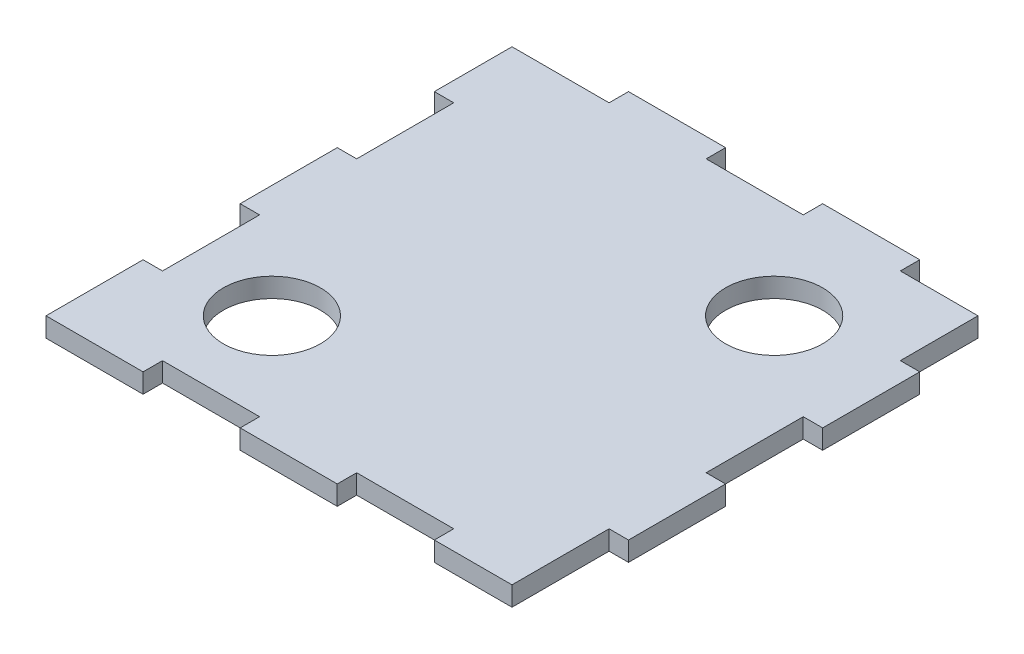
from build123d import *

# Parameters (mm, degrees)
SKETCH2_R           = 10
BOSS_EXTRUDE1_DEPTH = 4


with BuildPart() as part:
    # Sketch2 → Boss-Extrude1 (new body)
    with BuildSketch(Plane(origin=(0, 0, 0), x_dir=(1, 0, 0), z_dir=(0, 1, 0))):
        Polygon((-50, 46), (-30, 46), (-30, 50), (-10, 50), (-10, 46), (10, 46), (10, 50), (30, 50), (30, 46), (46, 46), (46, 30), (50, 30), (50, 10), (46, 10), (46, -10), (50, -10), (50, -30), (46, -30), (46, -50), (30, -50), (30, -46), (10, -46), (10, -50), (-10, -50), (-10, -46), (-30, -46), (-30, -50), (-50, -50), (-50, -30), (-46, -30), (-46, -10), (-50, -10), (-50, 10), (-46, 10), (-46, 30), (-50, 30), align=None)
        with Locations(Location((25, 25, 0), (0, 0, 270))):
            Circle(SKETCH2_R, mode=Mode.SUBTRACT)
        with Locations(Location((-26.732086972, -26.732086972, 0), (0, 0, 270))):
            Circle(SKETCH2_R, mode=Mode.SUBTRACT)
    extrude(amount=BOSS_EXTRUDE1_DEPTH)


solid = part.part
